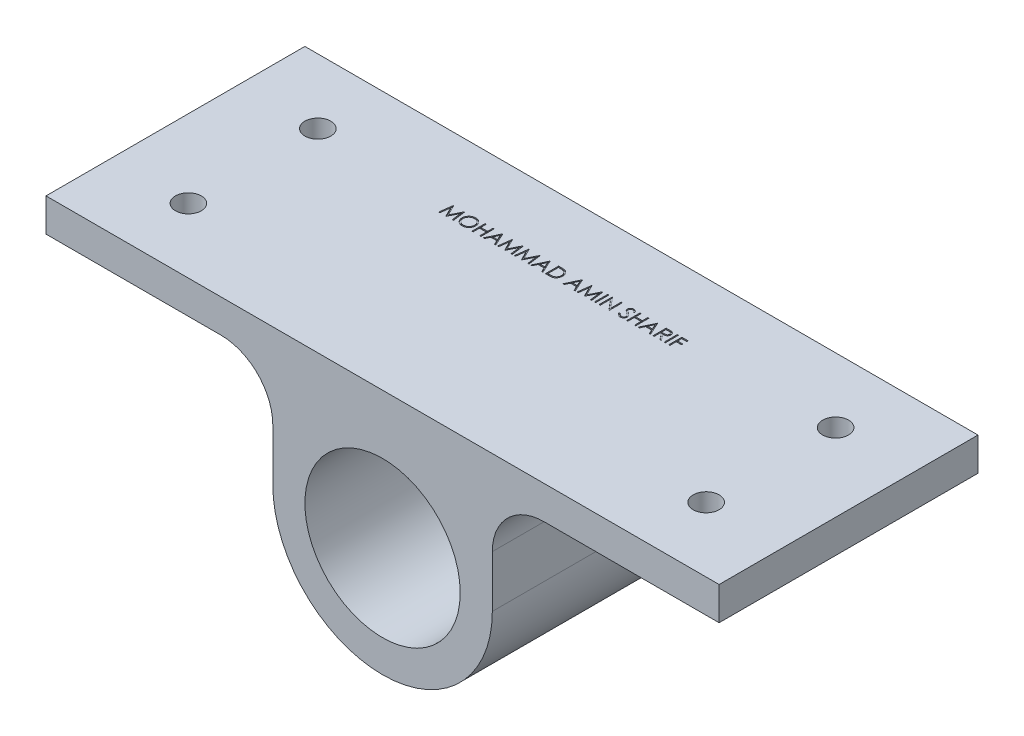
from build123d import *

# Parameters (mm, degrees)
BOSS_EXTRUDE1_DEPTH = 125
SKETCH2_R           = 75
CUT_EXTRUDE1_DEPTH  = 250
SKETCH3_R           = 12.5
CUT_EXTRUDE2_DEPTH  = 32
SKETCH6_W           = 1.139743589
SKETCH6_H           = 12.7
CUT_EXTRUDE3_DEPTH  = 1


with BuildPart() as part:
    # Sketch1 → Boss-Extrude1 (new, symmetric)
    with BuildSketch(Plane.XY):
        with BuildLine():
            Line((-325, 0), (325, 0))
            Line((325, 0), (325, -32))
            Line((325, -32), (156, -32))
            ThreePointArc((156, -32), (120.644660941, -46.644660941), (106, -82))
            Line((106, -82), (106, -132))
            ThreePointArc((106, -132), (0, -238), (-106, -132))
            Line((-106, -132), (-106, -82))
            ThreePointArc((-106, -82), (-120.644660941, -46.644660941), (-156, -32))
            Line((-156, -32), (-325, -32))
            Line((-325, -32), (-325, 0))
        make_face()
    extrude(amount=BOSS_EXTRUDE1_DEPTH, both=True)

    # Sketch2 → Cut-Extrude1 (cut)
    with BuildSketch(Plane.XY.offset(125)):
        with Locations((0, -132)):
            Circle(SKETCH2_R)
    extrude(amount=-CUT_EXTRUDE1_DEPTH, mode=Mode.SUBTRACT)

    # Sketch3 → Cut-Extrude2 (cut)
    with BuildSketch(Plane(origin=(0, 0, 0), x_dir=(1, 0, 0), z_dir=(0, 1, 0))):
        with Locations(Location((250, 62.5, 0), (0, 0, 270))):
            Circle(SKETCH3_R)
        with Locations(Location((-250, 62.5, 0), (0, 0, 180))):
            Circle(SKETCH3_R)
        with Locations(Location((250, -62.5, 0), (0, 0, 180))):
            Circle(SKETCH3_R)
        with Locations(Location((-250, -62.5, 0), (0, 0, 270))):
            Circle(SKETCH3_R)
    extrude(amount=-CUT_EXTRUDE2_DEPTH, mode=Mode.SUBTRACT)

    # Sketch6 → Cut-Extrude3 (cut)
    # profile 1 of 18: a face of its own
    with BuildSketch(Plane(origin=(0, 0, 0), x_dir=(1, 0, 0), z_dir=(0, 1, 0))):
        Polygon((-121.894845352, 51.114655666), (-120.218302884, 63.814655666), (-120.055482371, 63.814655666), (-114.812153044, 53.394142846), (-109.58408814, 63.814655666), (-109.421267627, 63.814655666), (-107.729460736, 51.114655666), (-108.869204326, 51.114655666), (-110.090358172, 60.245324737), (-114.672229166, 51.114655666), (-114.931724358, 51.114655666), (-119.533947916, 60.273309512), (-120.74746955, 51.114655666), align=None)
    # profile 2 of 18: a face of its own
    with BuildSketch(Plane(origin=(0, 0, 0), x_dir=(1, 0, 0), z_dir=(0, 1, 0))):
        with BuildLine():
            add(Edge.make_bspline(
                [(-99.181383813, 64.140296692), (-98.946222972, 64.134340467), (-98.484347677, 64.122641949), (-97.805533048, 64.033092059), (-97.157487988, 63.878168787), (-96.534933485, 63.671837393), (-95.945316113, 63.396594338), (-95.384197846, 63.063908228), (-94.85291376, 62.670293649), (-94.358624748, 62.218793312), (-93.906298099, 61.727544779), (-93.507787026, 61.203296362), (-93.173804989, 60.649217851), (-92.899536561, 60.066974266), (-92.68436732, 59.457882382), (-92.535889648, 58.818695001), (-92.441045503, 58.153553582), (-92.429957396, 57.699884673), (-92.424332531, 57.469743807)],
                knots=[0, 0, 0, 0, 1.065120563, 2.091984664, 3.0946048, 4.079830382, 5.057816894, 6.036188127, 7.030412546, 8.04752943, 9.064399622, 10.05169764, 11.02544977, 11.989514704, 12.962713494, 13.945757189, 14.957906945, 16, 16, 16, 16], degree=3))
            add(Edge.make_bspline(
                [(-92.424332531, 57.469743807), (-92.429956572, 57.241298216), (-92.441042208, 56.791005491), (-92.535997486, 56.130084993), (-92.684917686, 55.494755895), (-92.897538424, 54.886078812), (-93.170499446, 54.303411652), (-93.506705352, 53.748287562), (-93.902732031, 53.220524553), (-94.353425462, 52.725904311), (-94.844737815, 52.27234206), (-95.371716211, 51.87712214), (-95.922509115, 51.537037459), (-96.504204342, 51.265679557), (-97.109087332, 51.048792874), (-97.742571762, 50.900919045), (-98.401689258, 50.805534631), (-98.851164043, 50.79458173), (-99.079620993, 50.789014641)],
                knots=[0, 0, 0, 0, 1.043624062, 2.057103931, 3.04512605, 4.022047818, 4.998200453, 5.980619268, 6.982898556, 8.009068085, 9.034988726, 10.034168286, 11.015286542, 11.987931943, 12.962482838, 13.94673481, 14.956375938, 16, 16, 16, 16], degree=3))
            add(Edge.make_bspline(
                [(-99.079620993, 50.789014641), (-99.309760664, 50.794636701), (-99.763427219, 50.80571928), (-100.429404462, 50.900720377), (-101.069040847, 51.049278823), (-101.680507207, 51.261584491), (-102.264144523, 51.535967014), (-102.821094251, 51.87053719), (-103.349120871, 52.267528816), (-103.843846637, 52.718076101), (-104.296508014, 53.208555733), (-104.691149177, 53.734097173), (-105.025794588, 54.284389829), (-105.299255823, 54.860960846), (-105.515752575, 55.461022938), (-105.663452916, 56.088578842), (-105.759014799, 56.740050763), (-105.770026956, 57.183617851), (-105.775614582, 57.408686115)],
                knots=[0, 0, 0, 0, 1.053102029, 2.075944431, 3.073151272, 4.055350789, 5.033113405, 6.020478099, 7.024410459, 8.052272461, 9.079885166, 10.07527673, 11.055994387, 12.023226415, 12.992069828, 13.970394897, 14.97016774, 16, 16, 16, 16], degree=3))
            add(Edge.make_bspline(
                [(-105.775614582, 57.408686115), (-105.773674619, 57.559753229), (-105.769819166, 57.859981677), (-105.723403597, 58.305811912), (-105.656051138, 58.744472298), (-105.559524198, 59.174715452), (-105.433280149, 59.595488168), (-105.284319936, 60.009692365), (-105.102383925, 60.413130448), (-104.896714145, 60.807713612), (-104.667164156, 61.187290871), (-104.413615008, 61.546082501), (-104.144972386, 61.887099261), (-103.850465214, 62.201504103), (-103.539799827, 62.498443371), (-103.20793657, 62.773353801), (-102.856900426, 63.028714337), (-102.485180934, 63.258839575), (-102.101937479, 63.466971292), (-101.706870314, 63.645576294), (-101.30534504, 63.798869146), (-100.895481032, 63.923114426), (-100.478366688, 64.0212021), (-100.053091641, 64.087994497), (-99.619994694, 64.134528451), (-99.328216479, 64.138365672), (-99.181383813, 64.140296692)],
                knots=[0, 0, 0, 0, 1.037015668, 2.060948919, 3.074880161, 4.083647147, 5.086022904, 6.090072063, 7.104153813, 8.122640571, 9.144368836, 10.147691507, 11.138137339, 12.123020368, 13.103399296, 14.087645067, 15.080126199, 16.082011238, 17.087798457, 18.072939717, 19.057185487, 20.037253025, 21.01195951, 21.997135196, 22.992090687, 24, 24, 24, 24], degree=3))
        make_face()
        with BuildLine():
            add(Edge.make_bspline(
                [(-99.125414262, 62.837732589), (-99.245935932, 62.836263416), (-99.485827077, 62.833339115), (-99.842459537, 62.794819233), (-100.194401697, 62.73991935), (-100.54172624, 62.66160926), (-100.882979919, 62.554914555), (-101.221343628, 62.432120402), (-101.553731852, 62.28254673), (-101.879047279, 62.113554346), (-102.194424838, 61.926505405), (-102.492013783, 61.719779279), (-102.772584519, 61.498223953), (-103.035450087, 61.261322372), (-103.279838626, 61.007868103), (-103.510560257, 60.741703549), (-103.718367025, 60.455220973), (-103.908814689, 60.156188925), (-104.079240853, 59.844996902), (-104.230789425, 59.524921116), (-104.354755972, 59.193350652), (-104.455856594, 58.853882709), (-104.539675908, 58.507054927), (-104.592776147, 58.150236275), (-104.631719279, 57.785219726), (-104.634476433, 57.538542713), (-104.635870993, 57.413774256)],
                knots=[0, 0, 0, 0, 1.008559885, 2.007477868, 2.99961109, 3.989939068, 4.984837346, 5.991145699, 7.001802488, 8.033829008, 9.059044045, 10.069351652, 11.065060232, 12.050310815, 13.029377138, 14.011219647, 14.996725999, 15.989392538, 16.977580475, 17.965360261, 18.951710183, 19.937753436, 20.929683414, 21.935841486, 22.955955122, 24, 24, 24, 24], degree=3))
            add(Edge.make_bspline(
                [(-104.635870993, 57.413774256), (-104.631245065, 57.230305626), (-104.622144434, 56.869366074), (-104.542469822, 56.340435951), (-104.419744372, 55.832115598), (-104.238833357, 55.347186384), (-104.012589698, 54.881479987), (-103.733092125, 54.439127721), (-103.401952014, 54.020010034), (-103.025801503, 53.627052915), (-102.614601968, 53.268383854), (-102.177966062, 52.953556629), (-101.720571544, 52.687182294), (-101.241225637, 52.470175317), (-100.742487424, 52.298218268), (-100.221143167, 52.180367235), (-99.680665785, 52.102804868), (-99.312254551, 52.095356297), (-99.125414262, 52.091578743)],
                knots=[0, 0, 0, 0, 1.032063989, 2.030389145, 3.003944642, 3.970395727, 4.937377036, 5.913328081, 6.909231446, 7.93887556, 8.970685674, 9.976071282, 10.964166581, 11.944589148, 12.933237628, 13.927779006, 14.949070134, 16, 16, 16, 16], degree=3))
            add(Edge.make_bspline(
                [(-99.125414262, 52.091578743), (-98.999831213, 52.093304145), (-98.75076231, 52.096726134), (-98.380301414, 52.131192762), (-98.016514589, 52.186462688), (-97.659912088, 52.266039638), (-97.310898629, 52.365633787), (-96.968017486, 52.483953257), (-96.634920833, 52.631567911), (-96.307406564, 52.794664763), (-95.99391163, 52.980593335), (-95.69464327, 53.180303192), (-95.417144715, 53.401532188), (-95.154475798, 53.634913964), (-94.909083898, 53.885154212), (-94.682628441, 54.151927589), (-94.475871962, 54.436917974), (-94.285496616, 54.735496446), (-94.115667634, 55.047539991), (-93.96769776, 55.368776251), (-93.842163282, 55.69841422), (-93.740822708, 56.03692935), (-93.661409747, 56.383678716), (-93.60669118, 56.7391266), (-93.568415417, 57.102561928), (-93.565530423, 57.348375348), (-93.564076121, 57.472287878)],
                knots=[0, 0, 0, 0, 1.047197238, 2.076906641, 3.100256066, 4.114471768, 5.12198147, 6.126382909, 7.136867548, 8.15857795, 9.17633901, 10.174870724, 11.156907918, 12.133735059, 13.104061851, 14.077631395, 15.04955518, 16.038496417, 17.029181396, 18.010275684, 18.986308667, 19.968651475, 20.955262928, 21.950658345, 22.966943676, 24, 24, 24, 24], degree=3))
            add(Edge.make_bspline(
                [(-93.564076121, 57.472287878), (-93.565531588, 57.595352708), (-93.568418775, 57.839474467), (-93.606672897, 58.200375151), (-93.661467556, 58.553265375), (-93.740435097, 58.896759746), (-93.842217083, 59.230945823), (-93.967719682, 59.555509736), (-94.115712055, 59.871660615), (-94.28555904, 60.178617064), (-94.476479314, 60.473165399), (-94.685101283, 60.754751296), (-94.915026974, 61.018086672), (-95.159687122, 61.269672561), (-95.425192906, 61.504143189), (-95.71034163, 61.721576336), (-96.011671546, 61.92721936), (-96.330721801, 62.112732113), (-96.659992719, 62.284052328), (-96.997863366, 62.430831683), (-97.340506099, 62.555553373), (-97.687049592, 62.661932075), (-98.040410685, 62.739612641), (-98.398201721, 62.794868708), (-98.759927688, 62.833325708), (-99.0031988, 62.836258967), (-99.125414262, 62.837732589)],
                knots=[0, 0, 0, 0, 1.02996197, 2.043119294, 3.035359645, 4.018872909, 4.991431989, 5.957985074, 6.929999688, 7.912076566, 8.892894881, 9.867085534, 10.843653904, 11.817741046, 12.803660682, 13.806313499, 14.818574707, 15.856120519, 16.894564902, 17.924820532, 18.937903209, 19.946497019, 20.957711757, 21.963978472, 22.977135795, 24, 24, 24, 24], degree=3))
        make_face(mode=Mode.SUBTRACT)
    # profile 3 of 18: a face of its own
    with BuildSketch(Plane(origin=(0, 0, 0), x_dir=(1, 0, 0), z_dir=(0, 1, 0))):
        Polygon((-89.819204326, 63.814655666), (-88.679460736, 63.814655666), (-88.679460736, 58.604399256), (-82.166640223, 58.604399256), (-82.166640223, 63.814655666), (-81.026896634, 63.814655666), (-81.026896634, 51.114655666), (-82.166640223, 51.114655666), (-82.166640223, 57.301835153), (-88.679460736, 57.301835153), (-88.679460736, 51.114655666), (-89.819204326, 51.114655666), align=None)
    # profile 4 of 18: a face of its own
    with BuildSketch(Plane(origin=(0, 0, 0), x_dir=(1, 0, 0), z_dir=(0, 1, 0))):
        Polygon((-72.560229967, 63.814655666), (-66.698691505, 51.114655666), (-67.937653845, 51.114655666), (-69.815177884, 55.185168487), (-75.572409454, 55.185168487), (-77.500814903, 51.114655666), (-78.747409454, 51.114655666), (-72.72305048, 63.814655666), align=None)
        Polygon((-72.654360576, 61.336730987), (-74.951656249, 56.487732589), (-70.415578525, 56.487732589), align=None, mode=Mode.SUBTRACT)
    # profile 5 of 18: a face of its own
    with BuildSketch(Plane(origin=(0, 0, 0), x_dir=(1, 0, 0), z_dir=(0, 1, 0))):
        Polygon((-65.070486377, 51.114655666), (-63.393943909, 63.814655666), (-63.231123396, 63.814655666), (-57.987794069, 53.394142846), (-52.759729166, 63.814655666), (-52.596908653, 63.814655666), (-50.905101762, 51.114655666), (-52.044845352, 51.114655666), (-53.265999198, 60.245324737), (-57.847870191, 51.114655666), (-58.107365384, 51.114655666), (-62.709588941, 60.273309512), (-63.923110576, 51.114655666), align=None)
    # profile 6 of 18: a face of its own
    with BuildSketch(Plane(origin=(0, 0, 0), x_dir=(1, 0, 0), z_dir=(0, 1, 0))):
        Polygon((-48.951255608, 51.114655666), (-47.27471314, 63.814655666), (-47.111892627, 63.814655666), (-41.8685633, 53.394142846), (-36.640498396, 63.814655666), (-36.477677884, 63.814655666), (-34.785870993, 51.114655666), (-35.925614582, 51.114655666), (-37.146768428, 60.245324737), (-41.728639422, 51.114655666), (-41.988134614, 51.114655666), (-46.590358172, 60.273309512), (-47.803879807, 51.114655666), align=None)
    # profile 7 of 18: a face of its own
    with BuildSketch(Plane(origin=(0, 0, 0), x_dir=(1, 0, 0), z_dir=(0, 1, 0))):
        Polygon((-26.970486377, 63.814655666), (-21.108947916, 51.114655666), (-22.347910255, 51.114655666), (-24.225434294, 55.185168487), (-29.982665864, 55.185168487), (-31.911071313, 51.114655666), (-33.157665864, 51.114655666), (-27.13330689, 63.814655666), align=None)
        Polygon((-27.064616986, 61.336730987), (-29.361912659, 56.487732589), (-24.825834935, 56.487732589), align=None, mode=Mode.SUBTRACT)
    # profile 8 of 18: a face of its own
    with BuildSketch(Plane(origin=(0, 0, 0), x_dir=(1, 0, 0), z_dir=(0, 1, 0))):
        with BuildLine():
            Line((-18.829460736, 51.114655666), (-18.829460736, 63.814655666))
            Line((-18.829460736, 63.814655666), (-16.265037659, 63.814655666))
            add(Edge.make_bspline(
                [(-16.265037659, 63.814655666), (-16.041993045, 63.813049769), (-15.611072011, 63.809947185), (-14.988363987, 63.79027528), (-14.412205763, 63.75547559), (-13.884492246, 63.704786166), (-13.403774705, 63.642545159), (-12.971399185, 63.564529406), (-12.58512998, 63.472406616), (-12.347569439, 63.393864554), (-12.235229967, 63.356722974)],
                knots=[0, 0, 0, 0, 1.314313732, 2.53924729, 3.670748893, 4.714932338, 5.66265055, 6.526160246, 7.303039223, 8, 8, 8, 8], degree=3))
            add(Edge.make_bspline(
                [(-12.235229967, 63.356722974), (-12.088291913, 63.300731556), (-11.797747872, 63.190018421), (-11.384064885, 62.98117127), (-10.994627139, 62.744540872), (-10.627346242, 62.479815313), (-10.290611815, 62.179498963), (-9.971268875, 61.856348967), (-9.682381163, 61.498614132), (-9.417828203, 61.113713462), (-9.179301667, 60.706181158), (-8.971968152, 60.276793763), (-8.799777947, 59.827731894), (-8.656836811, 59.360244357), (-8.544182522, 58.873303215), (-8.46732237, 58.366341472), (-8.416627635, 57.841362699), (-8.411532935, 57.485129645), (-8.408947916, 57.304379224)],
                knots=[0, 0, 0, 0, 0.984719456, 1.947108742, 2.898477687, 3.838006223, 4.779231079, 5.722358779, 6.681677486, 7.655904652, 8.64651281, 9.637519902, 10.640069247, 11.656948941, 12.698408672, 13.768548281, 14.867775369, 16, 16, 16, 16], degree=3))
            add(Edge.make_bspline(
                [(-8.408947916, 57.304379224), (-8.411230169, 57.14740273), (-8.415727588, 56.838064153), (-8.456111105, 56.382167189), (-8.514808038, 55.939795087), (-8.605682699, 55.513054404), (-8.71600039, 55.098206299), (-8.857384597, 54.699672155), (-9.019347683, 54.313796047), (-9.208214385, 53.945795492), (-9.415555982, 53.597150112), (-9.638066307, 53.268490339), (-9.875508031, 52.964505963), (-10.130145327, 52.684276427), (-10.398687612, 52.428224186), (-10.682893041, 52.194210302), (-10.983494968, 51.98681366), (-11.299147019, 51.797884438), (-11.639057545, 51.633073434), (-12.009664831, 51.493627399), (-12.412549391, 51.37806968), (-12.84672232, 51.281655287), (-13.312933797, 51.205174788), (-13.811640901, 51.153916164), (-14.342077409, 51.119252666), (-14.706310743, 51.116217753), (-14.893783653, 51.114655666)],
                knots=[0, 0, 0, 0, 1.105936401, 2.179363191, 3.223086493, 4.248585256, 5.251745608, 6.245858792, 7.225916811, 8.198733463, 9.158002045, 10.082870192, 10.993790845, 11.873723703, 12.748670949, 13.606408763, 14.465103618, 15.319838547, 16.196477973, 17.123216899, 18.106603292, 19.147568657, 20.255746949, 21.433717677, 22.679120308, 24, 24, 24, 24], degree=3))
            Line((-14.893783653, 51.114655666), (-18.829460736, 51.114655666))
        make_face()
        with BuildLine():
            Line((-17.689717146, 52.417219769), (-16.231964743, 52.417219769))
            add(Edge.make_bspline(
                [(-16.231964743, 52.417219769), (-16.022493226, 52.418120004), (-15.619602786, 52.419851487), (-15.040272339, 52.435045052), (-14.510938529, 52.459871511), (-14.031526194, 52.494615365), (-13.602306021, 52.54058434), (-13.222380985, 52.591837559), (-12.892996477, 52.655691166), (-12.693681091, 52.713570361), (-12.601576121, 52.740316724)],
                knots=[0, 0, 0, 0, 1.375205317, 2.645023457, 3.804390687, 4.853969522, 5.800190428, 6.637939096, 7.370582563, 8, 8, 8, 8], degree=3))
            add(Edge.make_bspline(
                [(-12.601576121, 52.740316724), (-12.485649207, 52.781143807), (-12.256564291, 52.861822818), (-11.926795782, 53.008989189), (-11.619248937, 53.18331327), (-11.328563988, 53.377087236), (-11.058864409, 53.597145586), (-10.806954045, 53.838703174), (-10.57334008, 54.102989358), (-10.360436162, 54.389676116), (-10.16990603, 54.696979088), (-10.004910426, 55.021877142), (-9.860306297, 55.360810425), (-9.74680969, 55.718983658), (-9.657853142, 56.093194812), (-9.594844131, 56.483470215), (-9.555602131, 56.88973698), (-9.551024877, 57.166060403), (-9.548691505, 57.306923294)],
                knots=[0, 0, 0, 0, 0.998632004, 1.973411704, 2.929992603, 3.868527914, 4.809262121, 5.754881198, 6.702106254, 7.672490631, 8.653608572, 9.636854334, 10.631411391, 11.644891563, 12.686317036, 13.754757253, 14.855430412, 16, 16, 16, 16], degree=3))
            add(Edge.make_bspline(
                [(-9.548691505, 57.306923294), (-9.550554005, 57.455453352), (-9.554212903, 57.747241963), (-9.600202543, 58.175379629), (-9.66740933, 58.587152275), (-9.764595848, 58.982587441), (-9.88844218, 59.362456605), (-10.04299988, 59.724658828), (-10.219590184, 60.073019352), (-10.429696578, 60.399497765), (-10.659804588, 60.708264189), (-10.915175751, 60.991129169), (-11.191752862, 61.248737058), (-11.486519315, 61.485099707), (-11.807782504, 61.690707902), (-12.147974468, 61.874628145), (-12.512085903, 62.030714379), (-12.765406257, 62.113731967), (-12.89414423, 62.155921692)],
                knots=[0, 0, 0, 0, 1.122418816, 2.205001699, 3.251619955, 4.274784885, 5.280384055, 6.268708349, 7.249350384, 8.229342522, 9.199999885, 10.157847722, 11.105861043, 12.055065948, 13.010012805, 13.98527497, 14.976112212, 16, 16, 16, 16], degree=3))
            add(Edge.make_bspline(
                [(-12.89414423, 62.155921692), (-13.000646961, 62.18537273), (-13.227100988, 62.247993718), (-13.596632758, 62.316302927), (-14.012522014, 62.376553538), (-14.476615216, 62.427564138), (-14.988383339, 62.464166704), (-15.548219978, 62.491639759), (-16.156367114, 62.51016954), (-16.577943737, 62.511434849), (-16.796748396, 62.512091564)],
                knots=[0, 0, 0, 0, 0.674548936, 1.434276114, 2.292660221, 3.240891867, 4.284742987, 5.42552168, 6.663806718, 8, 8, 8, 8], degree=3))
            Line((-16.796748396, 62.512091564), (-17.689717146, 62.512091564))
            Line((-17.689717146, 62.512091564), (-17.689717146, 52.417219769))
        make_face(mode=Mode.SUBTRACT)
    # profile 9 of 18: a face of its own
    with BuildSketch(Plane(origin=(0, 0, 0), x_dir=(1, 0, 0), z_dir=(0, 1, 0))):
        Polygon((4.291052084, 63.814655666), (10.152590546, 51.114655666), (8.913628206, 51.114655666), (7.036104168, 55.185168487), (1.278872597, 55.185168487), (-0.649532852, 51.114655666), (-1.896127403, 51.114655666), (4.128231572, 63.814655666), align=None)
        Polygon((4.196921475, 61.336730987), (1.899625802, 56.487732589), (6.435703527, 56.487732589), align=None, mode=Mode.SUBTRACT)
    # profile 10 of 18: a face of its own
    with BuildSketch(Plane(origin=(0, 0, 0), x_dir=(1, 0, 0), z_dir=(0, 1, 0))):
        Polygon((11.780795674, 51.114655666), (13.457338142, 63.814655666), (13.620158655, 63.814655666), (18.863487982, 53.394142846), (24.091552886, 63.814655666), (24.254373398, 63.814655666), (25.94618029, 51.114655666), (24.8064367, 51.114655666), (23.585282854, 60.245324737), (19.00341186, 51.114655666), (18.743916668, 51.114655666), (14.14169311, 60.273309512), (12.928171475, 51.114655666), align=None)
    # profile 11 of 18: a face of its own
    with BuildSketch(Plane(origin=(0, 0, 0), x_dir=(1, 0, 0), z_dir=(0, 1, 0))):
        with Locations((29.12118029, 57.464655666)):
            Rectangle(SKETCH6_W, SKETCH6_H)
    # profile 12 of 18: a face of its own
    with BuildSketch(Plane(origin=(0, 0, 0), x_dir=(1, 0, 0), z_dir=(0, 1, 0))):
        Polygon((32.947462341, 51.114655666), (32.947462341, 63.814655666), (33.186604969, 63.814655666), (41.57694952, 53.819002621), (41.57694952, 63.814655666), (42.71669311, 63.814655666), (42.71669311, 51.114655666), (42.457197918, 51.114655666), (34.087205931, 61.087412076), (34.087205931, 51.114655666), align=None)
    # profile 13 of 18: a face of its own
    with BuildSketch(Plane(origin=(0, 0, 0), x_dir=(1, 0, 0), z_dir=(0, 1, 0))):
        with BuildLine():
            Line((49.555154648, 53.56459557), (50.628752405, 54.20824541))
            add(Edge.make_bspline(
                [(50.628752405, 54.20824541), (50.728604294, 54.041097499), (50.919916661, 53.720848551), (51.23905445, 53.288112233), (51.569736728, 52.920312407), (51.91441231, 52.619588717), (52.270977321, 52.382828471), (52.641759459, 52.215180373), (53.025509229, 52.110619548), (53.286671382, 52.097919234), (53.417053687, 52.091578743)],
                knots=[0, 0, 0, 0, 1.272034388, 2.437168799, 3.508375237, 4.49857839, 5.41946034, 6.295179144, 7.148887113, 8, 8, 8, 8], degree=3))
            add(Edge.make_bspline(
                [(53.417053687, 52.091578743), (53.528403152, 52.094679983), (53.749153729, 52.1008282), (54.074136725, 52.159904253), (54.389756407, 52.250662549), (54.68950775, 52.380641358), (54.969254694, 52.537898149), (55.214570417, 52.727839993), (55.426646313, 52.940496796), (55.6001251, 53.177742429), (55.733221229, 53.432893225), (55.835518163, 53.69478882), (55.89228743, 53.967543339), (55.900839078, 54.151187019), (55.905154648, 54.243862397)],
                knots=[0, 0, 0, 0, 1.095163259, 2.171163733, 3.241058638, 4.321873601, 5.38011039, 6.391990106, 7.366004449, 8.327778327, 9.272591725, 10.192022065, 11.087607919, 12, 12, 12, 12], degree=3))
            add(Edge.make_bspline(
                [(55.905154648, 54.243862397), (55.899805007, 54.349602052), (55.888929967, 54.564555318), (55.797012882, 54.881691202), (55.652417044, 55.19553567), (55.519021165, 55.389668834), (55.449766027, 55.490456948)],
                knots=[0, 0, 0, 0, 0.938893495, 1.908633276, 2.914225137, 4, 4, 4, 4], degree=3))
            add(Edge.make_bspline(
                [(55.449766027, 55.490456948), (55.392904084, 55.56319828), (55.273529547, 55.715909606), (55.068306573, 55.943222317), (54.827492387, 56.177694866), (54.559328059, 56.428280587), (54.254045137, 56.683324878), (53.921205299, 56.954989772), (53.552310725, 57.232944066), (53.293595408, 57.41935309), (53.160102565, 57.515537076)],
                knots=[0, 0, 0, 0, 0.722233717, 1.516239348, 2.393582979, 3.351407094, 4.387010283, 5.505090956, 6.712668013, 8, 8, 8, 8], degree=3))
            add(Edge.make_bspline(
                [(53.160102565, 57.515537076), (53.026484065, 57.61070938), (52.771015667, 57.792671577), (52.413751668, 58.062725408), (52.094276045, 58.309627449), (51.814008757, 58.535702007), (51.573073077, 58.740979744), (51.369570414, 58.923489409), (51.208684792, 59.088166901), (51.119220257, 59.194996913), (51.079052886, 59.242960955)],
                knots=[0, 0, 0, 0, 1.452282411, 2.77665338, 3.964542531, 5.026858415, 5.96415736, 6.766646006, 7.446254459, 8, 8, 8, 8], degree=3))
            add(Edge.make_bspline(
                [(51.079052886, 59.242960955), (51.02290965, 59.317713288), (50.912496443, 59.464723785), (50.766751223, 59.694502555), (50.642874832, 59.929718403), (50.545765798, 60.171003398), (50.463991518, 60.41497014), (50.408989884, 60.664801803), (50.374549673, 60.919377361), (50.37102275, 61.09069492), (50.369257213, 61.176454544)],
                knots=[0, 0, 0, 0, 1.068054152, 2.10047183, 3.106115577, 4.101338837, 5.06977816, 6.043150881, 7.020423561, 8, 8, 8, 8], degree=3))
            add(Edge.make_bspline(
                [(50.369257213, 61.176454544), (50.373993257, 61.310819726), (50.383364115, 61.576678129), (50.462613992, 61.965047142), (50.587701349, 62.335837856), (50.762942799, 62.685379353), (50.988848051, 63.004570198), (51.250272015, 63.297081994), (51.561645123, 63.542985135), (51.903284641, 63.757840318), (52.277232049, 63.926009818), (52.669084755, 64.052868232), (53.079465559, 64.124747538), (53.357425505, 64.135062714), (53.498463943, 64.140296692)],
                knots=[0, 0, 0, 0, 1.005424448, 1.989358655, 2.955360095, 3.929531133, 4.905563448, 5.876582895, 6.856512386, 7.866279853, 8.892233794, 9.918561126, 10.94386622, 12, 12, 12, 12], degree=3))
            add(Edge.make_bspline(
                [(53.498463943, 64.140296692), (53.648121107, 64.135134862), (53.945741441, 64.124869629), (54.383525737, 64.03561573), (54.805023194, 63.887930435), (55.144088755, 63.72033159), (55.409456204, 63.552940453), (55.611831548, 63.40046852), (55.816909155, 63.224935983), (56.02634324, 63.02587529), (56.236585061, 62.801459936), (56.450755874, 62.553226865), (56.669356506, 62.282693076), (56.809984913, 62.089564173), (56.882077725, 61.990557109)],
                knots=[0, 0, 0, 0, 1.286793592, 2.559021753, 3.825965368, 5.121522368, 5.803751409, 6.523245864, 7.299691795, 8.125521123, 9.008227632, 9.944561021, 10.946284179, 12, 12, 12, 12], degree=3))
            Line((56.882077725, 61.990557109), (55.851729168, 61.209527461))
            add(Edge.make_bspline(
                [(55.851729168, 61.209527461), (55.789513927, 61.289677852), (55.66970192, 61.444028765), (55.487803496, 61.660187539), (55.316358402, 61.857641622), (55.147446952, 62.029146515), (54.98999006, 62.184094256), (54.837165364, 62.316753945), (54.691172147, 62.428425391), (54.507142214, 62.547600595), (54.275937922, 62.665734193), (53.985708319, 62.765697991), (53.682409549, 62.825769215), (53.475836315, 62.83371175), (53.371260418, 62.837732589)],
                knots=[0, 0, 0, 0, 1.181633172, 2.275549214, 3.290209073, 4.226197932, 5.078386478, 5.862611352, 6.581680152, 7.217281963, 8.414376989, 9.595101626, 10.782541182, 12, 12, 12, 12], degree=3))
            add(Edge.make_bspline(
                [(53.371260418, 62.837732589), (53.240063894, 62.833335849), (52.987063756, 62.824857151), (52.627870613, 62.732256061), (52.304586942, 62.586453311), (52.026810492, 62.382110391), (51.795536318, 62.140008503), (51.628239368, 61.861410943), (51.527545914, 61.553771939), (51.515258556, 61.339172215), (51.509000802, 61.229880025)],
                knots=[0, 0, 0, 0, 1.14458467, 2.207223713, 3.21896685, 4.227309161, 5.202851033, 6.127160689, 7.046193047, 8, 8, 8, 8], degree=3))
            add(Edge.make_bspline(
                [(51.509000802, 61.229880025), (51.51042729, 61.161838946), (51.513282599, 61.025645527), (51.553105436, 60.824436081), (51.604265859, 60.623734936), (51.685337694, 60.424444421), (51.797262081, 60.223079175), (51.944238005, 60.016171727), (52.129343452, 59.801898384), (52.271137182, 59.662534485), (52.346000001, 59.588954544)],
                knots=[0, 0, 0, 0, 0.858281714, 1.717966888, 2.583508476, 3.4729293, 4.427298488, 5.488583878, 6.674047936, 8, 8, 8, 8], degree=3))
            add(Edge.make_bspline(
                [(52.346000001, 59.588954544), (52.373799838, 59.564145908), (52.439845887, 59.505206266), (52.560589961, 59.408714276), (52.720039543, 59.289687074), (52.914030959, 59.142413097), (53.1461411, 58.971574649), (53.416395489, 58.779356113), (53.721781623, 58.559517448), (53.93848686, 58.405820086), (54.053071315, 58.3245515)],
                knots=[0, 0, 0, 0, 0.420754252, 0.999615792, 1.744751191, 2.668019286, 3.750313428, 4.999500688, 6.413464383, 8, 8, 8, 8], degree=3))
            add(Edge.make_bspline(
                [(54.053071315, 58.3245515), (54.190905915, 58.224252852), (54.457803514, 58.030038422), (54.837561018, 57.738244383), (55.181889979, 57.452865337), (55.491999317, 57.175723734), (55.770952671, 56.908921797), (56.015655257, 56.649249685), (56.22860044, 56.39856775), (56.457850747, 56.077175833), (56.692103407, 55.682455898), (56.893276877, 55.19884629), (57.020125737, 54.713356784), (57.036713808, 54.387050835), (57.044898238, 54.226053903)],
                knots=[0, 0, 0, 0, 1.163667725, 2.253281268, 3.268753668, 4.215851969, 5.092017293, 5.902905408, 6.650798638, 7.335211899, 8.59617414, 9.77448103, 10.901945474, 12, 12, 12, 12], degree=3))
            add(Edge.make_bspline(
                [(57.044898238, 54.226053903), (57.042513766, 54.112195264), (57.037791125, 53.886689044), (56.983504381, 53.555563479), (56.90396731, 53.233960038), (56.784089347, 52.925854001), (56.637773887, 52.62560872), (56.452113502, 52.341100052), (56.236911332, 52.06603112), (55.990045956, 51.807736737), (55.719913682, 51.570623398), (55.434404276, 51.359697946), (55.133050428, 51.183827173), (54.817486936, 51.040314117), (54.487641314, 50.928069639), (54.143624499, 50.846742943), (53.784869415, 50.796829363), (53.541027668, 50.791648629), (53.417053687, 50.789014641)],
                knots=[0, 0, 0, 0, 0.983748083, 1.948392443, 2.894712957, 3.844097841, 4.80183111, 5.778335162, 6.776009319, 7.81870978, 8.863265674, 9.881300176, 10.883814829, 11.87499822, 12.874611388, 13.892143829, 14.928324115, 16, 16, 16, 16], degree=3))
            add(Edge.make_bspline(
                [(53.417053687, 50.789014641), (53.321131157, 50.7908695), (53.130494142, 50.794555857), (52.848519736, 50.827145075), (52.572241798, 50.873253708), (52.305127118, 50.946456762), (52.043734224, 51.035273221), (51.789199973, 51.144632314), (51.541401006, 51.275686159), (51.298948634, 51.425528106), (51.062459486, 51.599909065), (50.834151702, 51.803012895), (50.606534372, 52.029238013), (50.38632582, 52.284727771), (50.169071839, 52.565354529), (49.959055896, 52.873743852), (49.751930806, 53.208215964), (49.621971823, 53.44358356), (49.555154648, 53.56459557)],
                knots=[0, 0, 0, 0, 0.915332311, 1.819136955, 2.706846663, 3.586547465, 4.459518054, 5.340707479, 6.227863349, 7.133153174, 8.059268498, 9.028702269, 10.047606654, 11.120612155, 12.245963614, 13.433783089, 14.680604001, 16, 16, 16, 16], degree=3))
        make_face()
    # profile 14 of 18: a face of its own
    with BuildSketch(Plane(origin=(0, 0, 0), x_dir=(1, 0, 0), z_dir=(0, 1, 0))):
        Polygon((59.650026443, 63.814655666), (60.789770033, 63.814655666), (60.789770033, 58.604399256), (67.302590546, 58.604399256), (67.302590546, 63.814655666), (68.442334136, 63.814655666), (68.442334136, 51.114655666), (67.302590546, 51.114655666), (67.302590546, 57.301835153), (60.789770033, 57.301835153), (60.789770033, 51.114655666), (59.650026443, 51.114655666), align=None)
    # profile 15 of 18: a face of its own
    with BuildSketch(Plane(origin=(0, 0, 0), x_dir=(1, 0, 0), z_dir=(0, 1, 0))):
        Polygon((76.909000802, 63.814655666), (82.770539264, 51.114655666), (81.531576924, 51.114655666), (79.654052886, 55.185168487), (73.896821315, 55.185168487), (71.968415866, 51.114655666), (70.721821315, 51.114655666), (76.74618029, 63.814655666), align=None)
        Polygon((76.814870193, 61.336730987), (74.51757452, 56.487732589), (79.053652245, 56.487732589), align=None, mode=Mode.SUBTRACT)
    # profile 16 of 18: a face of its own
    with BuildSketch(Plane(origin=(0, 0, 0), x_dir=(1, 0, 0), z_dir=(0, 1, 0))):
        with BuildLine():
            Line((85.050026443, 63.814655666), (87.591552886, 63.814655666))
            add(Edge.make_bspline(
                [(87.591552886, 63.814655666), (87.761156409, 63.814091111), (88.086813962, 63.813007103), (88.553351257, 63.806962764), (88.977266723, 63.789638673), (89.358338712, 63.774730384), (89.696560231, 63.74754534), (89.9929684, 63.721562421), (90.246198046, 63.687549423), (90.399490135, 63.655961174), (90.468896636, 63.641658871)],
                knots=[0, 0, 0, 0, 1.410062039, 2.707475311, 3.878576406, 4.937260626, 5.877586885, 6.699081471, 7.410979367, 8, 8, 8, 8], degree=3))
            add(Edge.make_bspline(
                [(90.468896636, 63.641658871), (90.5618121, 63.618701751), (90.745660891, 63.573277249), (91.010365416, 63.477266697), (91.262603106, 63.366161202), (91.501326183, 63.235664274), (91.725338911, 63.084807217), (91.936951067, 62.916194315), (92.137122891, 62.730748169), (92.317759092, 62.523793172), (92.488080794, 62.306672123), (92.631730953, 62.071889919), (92.755561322, 61.826375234), (92.854151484, 61.567631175), (92.933537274, 61.298167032), (92.989512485, 61.015541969), (93.02308108, 60.721043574), (93.02649867, 60.520173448), (93.028231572, 60.418321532)],
                knots=[0, 0, 0, 0, 1.027469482, 2.033020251, 3.019912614, 3.986113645, 4.951240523, 5.91722682, 6.890402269, 7.87763091, 8.8651537, 9.85103654, 10.82876324, 11.815024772, 12.821070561, 13.842952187, 14.906261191, 16, 16, 16, 16], degree=3))
            add(Edge.make_bspline(
                [(93.028231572, 60.418321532), (93.022901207, 60.249102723), (93.012500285, 59.918913), (92.915526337, 59.439720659), (92.756680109, 58.992719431), (92.537792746, 58.578472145), (92.259047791, 58.205053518), (91.924040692, 57.877065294), (91.532584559, 57.602600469), (91.168169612, 57.41227172), (90.846263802, 57.290377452), (90.58125721, 57.204611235), (90.292179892, 57.13834639), (89.981801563, 57.078982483), (89.648830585, 57.034163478), (89.294065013, 57.001337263), (88.917251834, 56.980821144), (88.658392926, 56.977765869), (88.525226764, 56.976194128)],
                knots=[0, 0, 0, 0, 1.260483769, 2.459530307, 3.627416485, 4.787058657, 5.939039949, 7.08810263, 8.267026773, 9.491475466, 10.141966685, 10.831826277, 11.566392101, 12.351337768, 13.187381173, 14.07005841, 15.007169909, 16, 16, 16, 16], degree=3))
            Line((88.525226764, 56.976194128), (93.191052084, 51.114655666))
            Line((93.191052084, 51.114655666), (91.78163702, 51.114655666))
            Line((91.78163702, 51.114655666), (87.1158117, 56.976194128))
            Line((87.1158117, 56.976194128), (86.189770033, 56.976194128))
            Line((86.189770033, 56.976194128), (86.189770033, 51.114655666))
            Line((86.189770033, 51.114655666), (85.050026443, 51.114655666))
            Line((85.050026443, 51.114655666), (85.050026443, 63.814655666))
        make_face()
        with BuildLine():
            Line((86.189770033, 62.512091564), (86.189770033, 58.27875823))
            Line((86.189770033, 58.27875823), (88.515050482, 58.260949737))
            add(Edge.make_bspline(
                [(88.515050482, 58.260949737), (88.62361748, 58.260901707), (88.834051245, 58.260808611), (89.1384908, 58.275300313), (89.421955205, 58.291786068), (89.68336022, 58.317002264), (89.922822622, 58.34950001), (90.140222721, 58.390150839), (90.335915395, 58.43751118), (90.564147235, 58.510814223), (90.819005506, 58.626950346), (91.09597966, 58.795916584), (91.331845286, 59.008438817), (91.531118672, 59.251456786), (91.691245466, 59.518651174), (91.804137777, 59.806819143), (91.875774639, 60.108685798), (91.884223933, 60.316160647), (91.888487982, 60.420865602)],
                knots=[0, 0, 0, 0, 1.146690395, 2.22261258, 3.21895312, 4.145990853, 4.996080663, 5.770904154, 6.481378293, 7.121626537, 8.300444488, 9.431385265, 10.535395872, 11.636531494, 12.74115979, 13.810798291, 14.895190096, 16, 16, 16, 16], degree=3))
            add(Edge.make_bspline(
                [(91.888487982, 60.420865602), (91.884126, 60.522997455), (91.875482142, 60.725385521), (91.804910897, 61.021679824), (91.685569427, 61.301322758), (91.524743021, 61.563176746), (91.32880323, 61.800868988), (91.099050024, 62.004240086), (90.841765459, 62.172059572), (90.601295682, 62.279299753), (90.386360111, 62.345048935), (90.199743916, 62.391317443), (89.988882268, 62.428490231), (89.752751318, 62.458273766), (89.492359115, 62.483873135), (89.206389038, 62.501115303), (88.896738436, 62.51132561), (88.682119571, 62.511830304), (88.571020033, 62.512091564)],
                knots=[0, 0, 0, 0, 1.101028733, 2.181837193, 3.264309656, 4.369019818, 5.486613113, 6.575447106, 7.666700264, 8.788928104, 9.402425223, 10.0903467, 10.862060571, 11.710948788, 12.657782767, 13.684531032, 14.801375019, 16, 16, 16, 16], degree=3))
            Line((88.571020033, 62.512091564), (86.189770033, 62.512091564))
        make_face(mode=Mode.SUBTRACT)
    # profile 17 of 18: a face of its own
    with BuildSketch(Plane(origin=(0, 0, 0), x_dir=(1, 0, 0), z_dir=(0, 1, 0))):
        with Locations((96.366052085, 57.464655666)):
            Rectangle(SKETCH6_W, SKETCH6_H)
    # profile 18 of 18: a face of its own
    with BuildSketch(Plane(origin=(0, 0, 0), x_dir=(1, 0, 0), z_dir=(0, 1, 0))):
        Polygon((100.192334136, 63.814655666), (106.379513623, 63.814655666), (106.379513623, 62.512091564), (101.332077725, 62.512091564), (101.332077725, 58.604399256), (106.379513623, 58.604399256), (106.379513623, 57.301835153), (101.332077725, 57.301835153), (101.332077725, 51.114655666), (100.192334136, 51.114655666), align=None)
    extrude(amount=-CUT_EXTRUDE3_DEPTH, mode=Mode.SUBTRACT)


solid = part.part
